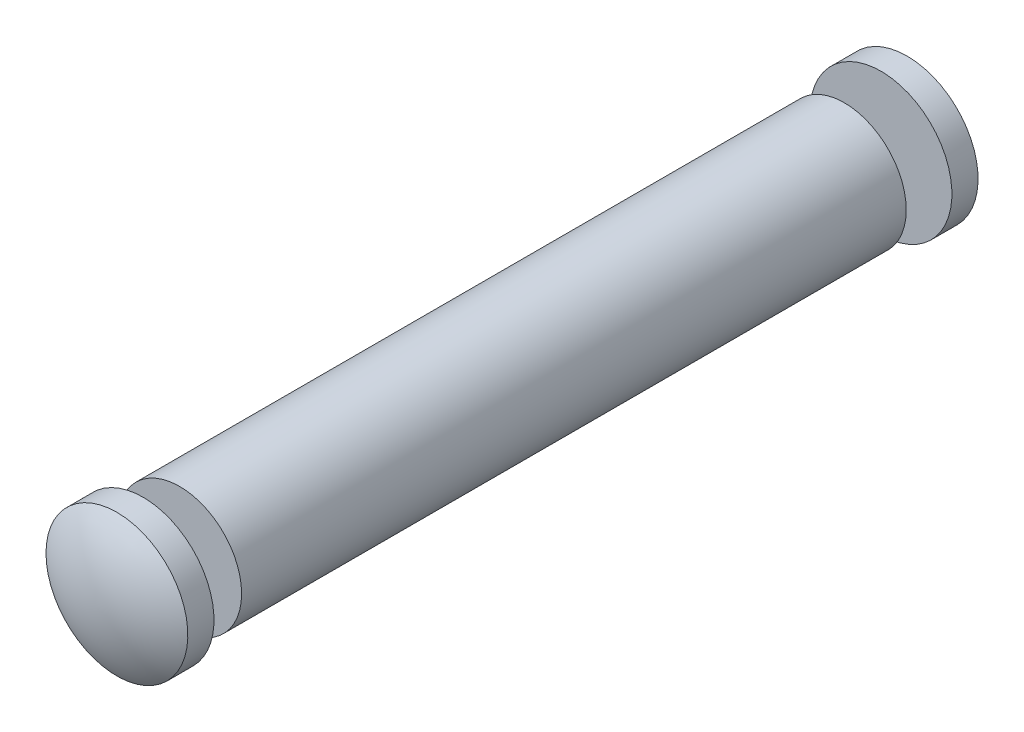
ISO-10303-21;
HEADER;
FILE_DESCRIPTION(('STEP AP214'),'2;1');
FILE_NAME('part.step','',(''),(''),'','','');
FILE_SCHEMA(('AUTOMOTIVE_DESIGN { 1 0 10303 214 1 1 1 1 }'));
ENDSEC;
DATA;
#1=APPLICATION_CONTEXT('core data for automotive mechanical design processes');
#2=APPLICATION_PROTOCOL_DEFINITION('international standard','automotive_design',2000,#1);
#3=PRODUCT_CONTEXT('',#1,'mechanical');
#4=PRODUCT('Part','Part','',(#3));
#5=PRODUCT_RELATED_PRODUCT_CATEGORY('part','',(#4));
#6=PRODUCT_DEFINITION_FORMATION('','',#4);
#7=PRODUCT_DEFINITION_CONTEXT('part definition',#1,'design');
#8=PRODUCT_DEFINITION('design','',#6,#7);
#9=PRODUCT_DEFINITION_SHAPE('','',#8);
#10=(LENGTH_UNIT() NAMED_UNIT(*) SI_UNIT(.MILLI.,.METRE.));
#11=(NAMED_UNIT(*) PLANE_ANGLE_UNIT() SI_UNIT($,.RADIAN.));
#12=(NAMED_UNIT(*) SI_UNIT($,.STERADIAN.) SOLID_ANGLE_UNIT());
#13=UNCERTAINTY_MEASURE_WITH_UNIT(LENGTH_MEASURE(1.E-05),#10,'distance_accuracy_value','');
#14=(GEOMETRIC_REPRESENTATION_CONTEXT(3) GLOBAL_UNCERTAINTY_ASSIGNED_CONTEXT((#13)) GLOBAL_UNIT_ASSIGNED_CONTEXT((#10,
#11,#12)) REPRESENTATION_CONTEXT('',''));
#15=CARTESIAN_POINT('',(0.,0.,0.));
#16=DIRECTION('',(0.,0.,1.));
#17=DIRECTION('',(1.,0.,0.));
#18=AXIS2_PLACEMENT_3D('',#15,#16,#17);
#19=CARTESIAN_POINT('',(0.,0.,1.60915662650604));
#20=DIRECTION('',(0.,0.,-1.));
#21=DIRECTION('',(0.,1.,0.));
#22=AXIS2_PLACEMENT_3D('',#19,#20,#21);
#23=SPHERICAL_SURFACE('',#22,4.83915662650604);
#24=CARTESIAN_POINT('',(0.,0.,-2.4));
#25=DIRECTION('',(0.,0.,-1.));
#26=DIRECTION('',(-1.,0.,0.));
#27=AXIS2_PLACEMENT_3D('',#24,#25,#26);
#28=CIRCLE('',#27,2.71);
#29=CARTESIAN_POINT('',(-2.71,0.,-2.4));
#30=VERTEX_POINT('',#29);
#31=EDGE_CURVE('E47',#30,#30,#28,.T.);
#32=ORIENTED_EDGE('',*,*,#31,.T.);
#33=EDGE_LOOP('',(#32));
#34=FACE_BOUND('',#33,.T.);
#35=ADVANCED_FACE('F41',(#34),#23,.T.);
#36=CARTESIAN_POINT('',(0.,0.,-1.4));
#37=DIRECTION('',(0.,0.,1.));
#38=DIRECTION('',(1.,0.,0.));
#39=AXIS2_PLACEMENT_3D('',#36,#37,#38);
#40=PLANE('',#39);
#41=CARTESIAN_POINT('',(0.,0.,-1.4));
#42=DIRECTION('',(0.,0.,-1.));
#43=DIRECTION('',(-1.,0.,0.));
#44=AXIS2_PLACEMENT_3D('',#41,#42,#43);
#45=CIRCLE('',#44,2.71);
#46=CARTESIAN_POINT('',(-2.71,0.,-1.4));
#47=VERTEX_POINT('',#46);
#48=EDGE_CURVE('E11',#47,#47,#45,.T.);
#49=ORIENTED_EDGE('',*,*,#48,.F.);
#50=EDGE_LOOP('',(#49));
#51=FACE_BOUND('',#50,.T.);
#52=ADVANCED_FACE('F56',(#51),#40,.T.);
#53=CARTESIAN_POINT('',(0.,0.,0.));
#54=DIRECTION('',(0.,0.,-1.));
#55=DIRECTION('',(-1.,0.,0.));
#56=AXIS2_PLACEMENT_3D('',#53,#54,#55);
#57=CYLINDRICAL_SURFACE('',#56,2.71);
#58=ORIENTED_EDGE('',*,*,#48,.T.);
#59=EDGE_LOOP('',(#58));
#60=FACE_BOUND('',#59,.T.);
#61=ORIENTED_EDGE('',*,*,#31,.F.);
#62=EDGE_LOOP('',(#61));
#63=FACE_BOUND('',#62,.T.);
#64=ADVANCED_FACE('F54',(#60,#63),#57,.T.);
#65=CLOSED_SHELL('',(#35,#52,#64));
#66=MANIFOLD_SOLID_BREP('B2',#65);
#67=CARTESIAN_POINT('',(0.,0.,26.8));
#68=DIRECTION('',(0.,0.,-1.));
#69=DIRECTION('',(-1.,0.,0.));
#70=AXIS2_PLACEMENT_3D('',#67,#68,#69);
#71=PLANE('',#70);
#72=CARTESIAN_POINT('',(0.,0.,26.8));
#73=DIRECTION('',(0.,0.,-1.));
#74=DIRECTION('',(-1.,0.,0.));
#75=AXIS2_PLACEMENT_3D('',#72,#73,#74);
#76=CIRCLE('',#75,2.71);
#77=CARTESIAN_POINT('',(-2.71,0.,26.8));
#78=VERTEX_POINT('',#77);
#79=EDGE_CURVE('E40',#78,#78,#76,.T.);
#80=ORIENTED_EDGE('',*,*,#79,.T.);
#81=EDGE_LOOP('',(#80));
#82=FACE_BOUND('',#81,.T.);
#83=ADVANCED_FACE('F88',(#82),#71,.T.);
#84=CARTESIAN_POINT('',(0.,0.,0.));
#85=DIRECTION('',(0.,0.,-1.));
#86=DIRECTION('',(-1.,0.,0.));
#87=AXIS2_PLACEMENT_3D('',#84,#85,#86);
#88=CYLINDRICAL_SURFACE('',#87,2.71);
#89=CARTESIAN_POINT('',(0.,0.,27.8));
#90=DIRECTION('',(0.,0.,-1.));
#91=DIRECTION('',(-1.,0.,0.));
#92=AXIS2_PLACEMENT_3D('',#89,#90,#91);
#93=CIRCLE('',#92,2.71);
#94=CARTESIAN_POINT('',(-2.71,0.,27.8));
#95=VERTEX_POINT('',#94);
#96=EDGE_CURVE('E94',#95,#95,#93,.T.);
#97=ORIENTED_EDGE('',*,*,#96,.T.);
#98=EDGE_LOOP('',(#97));
#99=FACE_BOUND('',#98,.T.);
#100=ORIENTED_EDGE('',*,*,#79,.F.);
#101=EDGE_LOOP('',(#100));
#102=FACE_BOUND('',#101,.T.);
#103=ADVANCED_FACE('F100',(#99,#102),#88,.T.);
#104=CARTESIAN_POINT('',(0.,0.,23.790843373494));
#105=DIRECTION('',(0.,0.,-1.));
#106=DIRECTION('',(0.,1.,0.));
#107=AXIS2_PLACEMENT_3D('',#104,#105,#106);
#108=SPHERICAL_SURFACE('',#107,4.83915662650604);
#109=ORIENTED_EDGE('',*,*,#96,.F.);
#110=EDGE_LOOP('',(#109));
#111=FACE_BOUND('',#110,.T.);
#112=ADVANCED_FACE('F103',(#111),#108,.T.);
#113=CLOSED_SHELL('',(#83,#103,#112));
#114=MANIFOLD_SOLID_BREP('B6',#113);
#115=CARTESIAN_POINT('',(0.,0.,25.4));
#116=DIRECTION('',(0.,0.,-1.));
#117=DIRECTION('',(-1.,0.,0.));
#118=AXIS2_PLACEMENT_3D('',#115,#116,#117);
#119=CYLINDRICAL_SURFACE('',#118,2.365);
#120=CARTESIAN_POINT('',(0.,0.,25.4));
#121=DIRECTION('',(0.,0.,1.));
#122=DIRECTION('',(1.,0.,0.));
#123=AXIS2_PLACEMENT_3D('',#120,#121,#122);
#124=CIRCLE('',#123,2.365);
#125=CARTESIAN_POINT('',(2.365,0.,25.4));
#126=VERTEX_POINT('',#125);
#127=EDGE_CURVE('E87',#126,#126,#124,.T.);
#128=ORIENTED_EDGE('',*,*,#127,.F.);
#129=EDGE_LOOP('',(#128));
#130=FACE_BOUND('',#129,.T.);
#131=CARTESIAN_POINT('',(0.,0.,0.));
#132=DIRECTION('',(0.,0.,1.));
#133=DIRECTION('',(1.,0.,0.));
#134=AXIS2_PLACEMENT_3D('',#131,#132,#133);
#135=CIRCLE('',#134,2.365);
#136=CARTESIAN_POINT('',(2.365,0.,0.));
#137=VERTEX_POINT('',#136);
#138=EDGE_CURVE('E131',#137,#137,#135,.T.);
#139=ORIENTED_EDGE('',*,*,#138,.T.);
#140=EDGE_LOOP('',(#139));
#141=FACE_BOUND('',#140,.T.);
#142=ADVANCED_FACE('F128',(#130,#141),#119,.T.);
#143=CARTESIAN_POINT('',(0.,0.,25.4));
#144=DIRECTION('',(0.,0.,1.));
#145=DIRECTION('',(1.,0.,0.));
#146=AXIS2_PLACEMENT_3D('',#143,#144,#145);
#147=PLANE('',#146);
#148=ORIENTED_EDGE('',*,*,#127,.T.);
#149=EDGE_LOOP('',(#148));
#150=FACE_BOUND('',#149,.T.);
#151=ADVANCED_FACE('F143',(#150),#147,.T.);
#152=CARTESIAN_POINT('',(0.,0.,0.));
#153=DIRECTION('',(0.,0.,1.));
#154=DIRECTION('',(1.,0.,0.));
#155=AXIS2_PLACEMENT_3D('',#152,#153,#154);
#156=PLANE('',#155);
#157=ORIENTED_EDGE('',*,*,#138,.F.);
#158=EDGE_LOOP('',(#157));
#159=FACE_BOUND('',#158,.T.);
#160=ADVANCED_FACE('F141',(#159),#156,.F.);
#161=CLOSED_SHELL('',(#142,#151,#160));
#162=MANIFOLD_SOLID_BREP('B35',#161);
#163=ADVANCED_BREP_SHAPE_REPRESENTATION('',(#18,#66,#114,#162),#14);
#164=SHAPE_DEFINITION_REPRESENTATION(#9,#163);
ENDSEC;
END-ISO-10303-21;
